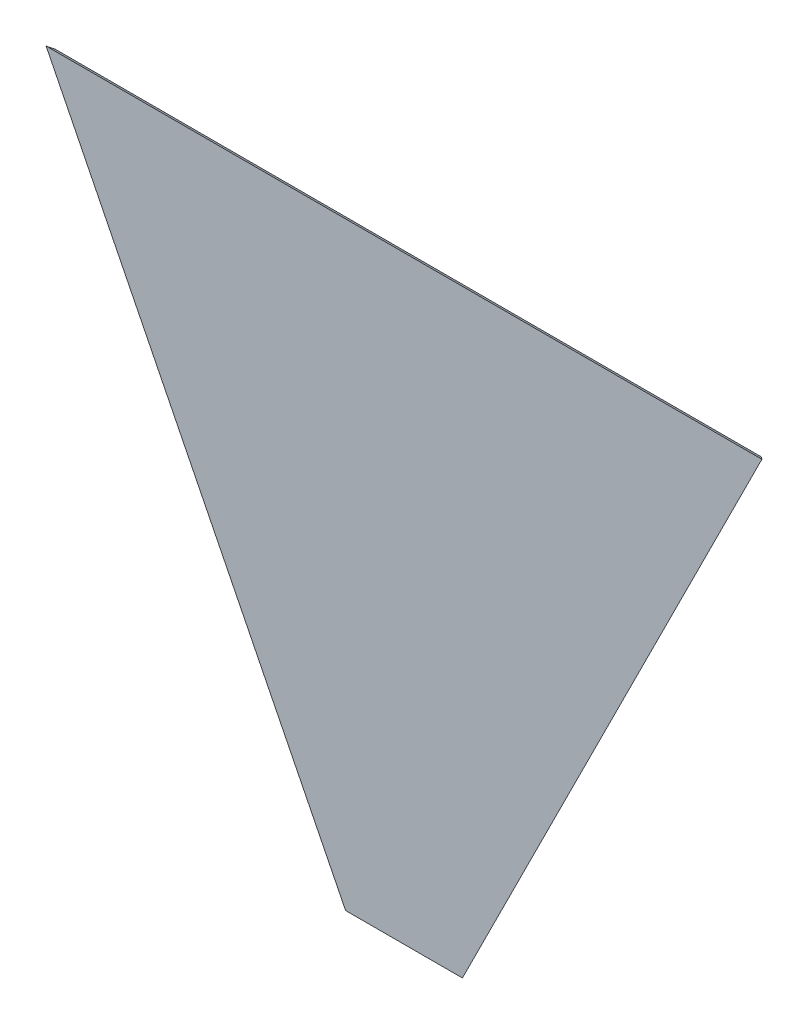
ISO-10303-21;
HEADER;
FILE_DESCRIPTION(('STEP AP214'),'2;1');
FILE_NAME('part.step','',(''),(''),'','','');
FILE_SCHEMA(('AUTOMOTIVE_DESIGN { 1 0 10303 214 1 1 1 1 }'));
ENDSEC;
DATA;
#1=APPLICATION_CONTEXT('core data for automotive mechanical design processes');
#2=APPLICATION_PROTOCOL_DEFINITION('international standard','automotive_design',2000,#1);
#3=PRODUCT_CONTEXT('',#1,'mechanical');
#4=PRODUCT('Part','Part','',(#3));
#5=PRODUCT_RELATED_PRODUCT_CATEGORY('part','',(#4));
#6=PRODUCT_DEFINITION_FORMATION('','',#4);
#7=PRODUCT_DEFINITION_CONTEXT('part definition',#1,'design');
#8=PRODUCT_DEFINITION('design','',#6,#7);
#9=PRODUCT_DEFINITION_SHAPE('','',#8);
#10=(LENGTH_UNIT() NAMED_UNIT(*) SI_UNIT(.MILLI.,.METRE.));
#11=(NAMED_UNIT(*) PLANE_ANGLE_UNIT() SI_UNIT($,.RADIAN.));
#12=(NAMED_UNIT(*) SI_UNIT($,.STERADIAN.) SOLID_ANGLE_UNIT());
#13=UNCERTAINTY_MEASURE_WITH_UNIT(LENGTH_MEASURE(1.E-05),#10,'distance_accuracy_value','');
#14=(GEOMETRIC_REPRESENTATION_CONTEXT(3) GLOBAL_UNCERTAINTY_ASSIGNED_CONTEXT((#13)) GLOBAL_UNIT_ASSIGNED_CONTEXT((#10,
#11,#12)) REPRESENTATION_CONTEXT('',''));
#15=CARTESIAN_POINT('',(0.,0.,0.));
#16=DIRECTION('',(0.,0.,1.));
#17=DIRECTION('',(1.,0.,0.));
#18=AXIS2_PLACEMENT_3D('',#15,#16,#17);
#19=CARTESIAN_POINT('',(-480.7735026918,702.88675134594,5.));
#20=DIRECTION('',(-0.707106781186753,-0.353553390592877,-0.612372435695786));
#21=DIRECTION('',(-0.654653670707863,0.,0.755928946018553));
#22=AXIS2_PLACEMENT_3D('',#19,#20,#21);
#23=PLANE('',#22);
#24=DIRECTION('',(-0.447213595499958,0.894427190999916,0.));
#25=VECTOR('',#24,1.);
#26=CARTESIAN_POINT('',(-125.,0.,0.));
#27=LINE('',#26,#25);
#28=CARTESIAN_POINT('',(-125.,0.,0.));
#29=VERTEX_POINT('',#28);
#30=CARTESIAN_POINT('',(-825.,1400.,0.));
#31=VERTEX_POINT('',#30);
#32=EDGE_CURVE('E87',#29,#31,#27,.T.);
#33=ORIENTED_EDGE('',*,*,#32,.F.);
#34=DIRECTION('',(0.707106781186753,-0.353553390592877,-0.612372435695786));
#35=VECTOR('',#34,1.);
#36=CARTESIAN_POINT('',(-136.5470053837,5.773502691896,10.));
#37=LINE('',#36,#35);
#38=CARTESIAN_POINT('',(-136.5470053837,5.773502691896,10.));
#39=VERTEX_POINT('',#38);
#40=EDGE_CURVE('E102',#39,#29,#37,.T.);
#41=ORIENTED_EDGE('',*,*,#40,.F.);
#42=DIRECTION('',(0.447213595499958,-0.894427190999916,0.));
#43=VECTOR('',#42,1.);
#44=CARTESIAN_POINT('',(-836.5470053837,1405.773502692,10.));
#45=LINE('',#44,#43);
#46=CARTESIAN_POINT('',(-836.5470053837,1405.773502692,10.));
#47=VERTEX_POINT('',#46);
#48=EDGE_CURVE('E73',#47,#39,#45,.T.);
#49=ORIENTED_EDGE('',*,*,#48,.F.);
#50=DIRECTION('',(-0.707106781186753,0.353553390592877,0.612372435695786));
#51=VECTOR('',#50,1.);
#52=CARTESIAN_POINT('',(-825.,1400.,0.));
#53=LINE('',#52,#51);
#54=EDGE_CURVE('E10',#31,#47,#53,.T.);
#55=ORIENTED_EDGE('',*,*,#54,.F.);
#56=EDGE_LOOP('',(#33,#41,#49,#55));
#57=FACE_BOUND('',#56,.T.);
#58=ADVANCED_FACE('F16',(#57),#23,.T.);
#59=CARTESIAN_POINT('',(0.,1402.906617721,5.03440957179));
#60=DIRECTION('',(0.,0.866025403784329,-0.50000000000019));
#61=DIRECTION('',(-1.,0.,0.));
#62=AXIS2_PLACEMENT_3D('',#59,#60,#61);
#63=PLANE('',#62);
#64=DIRECTION('',(1.,0.,0.));
#65=VECTOR('',#64,1.);
#66=CARTESIAN_POINT('',(-825.,1400.,0.));
#67=LINE('',#66,#65);
#68=CARTESIAN_POINT('',(825.,1400.,0.));
#69=VERTEX_POINT('',#68);
#70=EDGE_CURVE('E67',#31,#69,#67,.T.);
#71=ORIENTED_EDGE('',*,*,#70,.F.);
#72=ORIENTED_EDGE('',*,*,#54,.T.);
#73=DIRECTION('',(-1.,0.,0.));
#74=VECTOR('',#73,1.);
#75=CARTESIAN_POINT('',(836.54700538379,1405.773502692,10.));
#76=LINE('',#75,#74);
#77=CARTESIAN_POINT('',(836.54700538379,1405.773502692,10.));
#78=VERTEX_POINT('',#77);
#79=EDGE_CURVE('E70',#78,#47,#76,.T.);
#80=ORIENTED_EDGE('',*,*,#79,.F.);
#81=DIRECTION('',(0.707106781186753,0.353553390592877,0.612372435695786));
#82=VECTOR('',#81,1.);
#83=CARTESIAN_POINT('',(825.,1400.,0.));
#84=LINE('',#83,#82);
#85=EDGE_CURVE('E19',#69,#78,#84,.T.);
#86=ORIENTED_EDGE('',*,*,#85,.F.);
#87=EDGE_LOOP('',(#71,#72,#80,#86));
#88=FACE_BOUND('',#87,.T.);
#89=ADVANCED_FACE('F65',(#88),#63,.T.);
#90=CARTESIAN_POINT('',(480.77350269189,702.88675134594,5.));
#91=DIRECTION('',(0.707106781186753,-0.353553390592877,-0.612372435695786));
#92=DIRECTION('',(0.,-0.866025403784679,0.499999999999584));
#93=AXIS2_PLACEMENT_3D('',#90,#91,#92);
#94=PLANE('',#93);
#95=DIRECTION('',(-0.447213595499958,-0.894427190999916,0.));
#96=VECTOR('',#95,1.);
#97=CARTESIAN_POINT('',(825.,1400.,0.));
#98=LINE('',#97,#96);
#99=CARTESIAN_POINT('',(125.,0.,0.));
#100=VERTEX_POINT('',#99);
#101=EDGE_CURVE('E75',#69,#100,#98,.T.);
#102=ORIENTED_EDGE('',*,*,#101,.F.);
#103=ORIENTED_EDGE('',*,*,#85,.T.);
#104=DIRECTION('',(0.447213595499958,0.894427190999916,0.));
#105=VECTOR('',#104,1.);
#106=CARTESIAN_POINT('',(136.54700538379,5.773502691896,10.));
#107=LINE('',#106,#105);
#108=CARTESIAN_POINT('',(136.54700538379,5.773502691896,10.));
#109=VERTEX_POINT('',#108);
#110=EDGE_CURVE('E105',#109,#78,#107,.T.);
#111=ORIENTED_EDGE('',*,*,#110,.F.);
#112=DIRECTION('',(0.707106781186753,0.353553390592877,0.612372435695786));
#113=VECTOR('',#112,1.);
#114=CARTESIAN_POINT('',(125.,0.,0.));
#115=LINE('',#114,#113);
#116=EDGE_CURVE('E78',#100,#109,#115,.T.);
#117=ORIENTED_EDGE('',*,*,#116,.F.);
#118=EDGE_LOOP('',(#102,#103,#111,#117));
#119=FACE_BOUND('',#118,.T.);
#120=ADVANCED_FACE('F76',(#119),#94,.T.);
#121=CARTESIAN_POINT('',(0.,898.81292692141,10.));
#122=DIRECTION('',(0.,0.,1.));
#123=DIRECTION('',(1.,0.,0.));
#124=AXIS2_PLACEMENT_3D('',#121,#122,#123);
#125=PLANE('',#124);
#126=DIRECTION('',(1.,0.,0.));
#127=VECTOR('',#126,1.);
#128=CARTESIAN_POINT('',(-136.5470053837,5.773502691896,10.));
#129=LINE('',#128,#127);
#130=EDGE_CURVE('E98',#39,#109,#129,.T.);
#131=ORIENTED_EDGE('',*,*,#130,.T.);
#132=ORIENTED_EDGE('',*,*,#110,.T.);
#133=ORIENTED_EDGE('',*,*,#79,.T.);
#134=ORIENTED_EDGE('',*,*,#48,.T.);
#135=EDGE_LOOP('',(#131,#132,#133,#134));
#136=FACE_BOUND('',#135,.T.);
#137=ADVANCED_FACE('F114',(#136),#125,.T.);
#138=CARTESIAN_POINT('',(0.,3.006708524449,5.207771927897));
#139=DIRECTION('',(0.,-0.866025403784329,0.50000000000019));
#140=DIRECTION('',(-1.,0.,0.));
#141=AXIS2_PLACEMENT_3D('',#138,#139,#140);
#142=PLANE('',#141);
#143=DIRECTION('',(-1.,0.,0.));
#144=VECTOR('',#143,1.);
#145=CARTESIAN_POINT('',(125.,0.,0.));
#146=LINE('',#145,#144);
#147=EDGE_CURVE('E83',#100,#29,#146,.T.);
#148=ORIENTED_EDGE('',*,*,#147,.F.);
#149=ORIENTED_EDGE('',*,*,#116,.T.);
#150=ORIENTED_EDGE('',*,*,#130,.F.);
#151=ORIENTED_EDGE('',*,*,#40,.T.);
#152=EDGE_LOOP('',(#148,#149,#150,#151));
#153=FACE_BOUND('',#152,.T.);
#154=ADVANCED_FACE('F118',(#153),#142,.T.);
#155=CARTESIAN_POINT('',(0.,894.8118360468,0.));
#156=DIRECTION('',(0.,0.,-1.));
#157=DIRECTION('',(0.,-1.,0.));
#158=AXIS2_PLACEMENT_3D('',#155,#156,#157);
#159=PLANE('',#158);
#160=ORIENTED_EDGE('',*,*,#32,.T.);
#161=ORIENTED_EDGE('',*,*,#70,.T.);
#162=ORIENTED_EDGE('',*,*,#101,.T.);
#163=ORIENTED_EDGE('',*,*,#147,.T.);
#164=EDGE_LOOP('',(#160,#161,#162,#163));
#165=FACE_BOUND('',#164,.T.);
#166=ADVANCED_FACE('F85',(#165),#159,.T.);
#167=CLOSED_SHELL('',(#58,#89,#120,#137,#154,#166));
#168=MANIFOLD_SOLID_BREP('B1',#167);
#169=ADVANCED_BREP_SHAPE_REPRESENTATION('',(#18,#168),#14);
#170=SHAPE_DEFINITION_REPRESENTATION(#9,#169);
ENDSEC;
END-ISO-10303-21;
